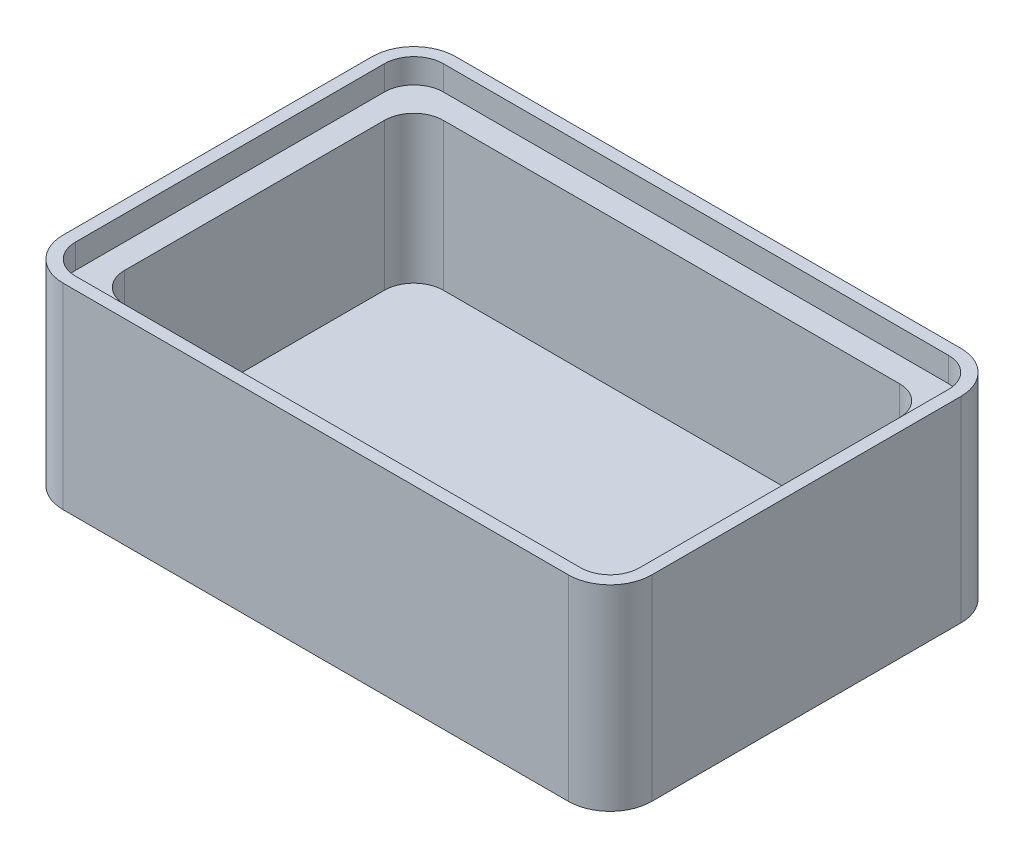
ISO-10303-21;
HEADER;
FILE_DESCRIPTION(('STEP AP214'),'2;1');
FILE_NAME('part.step','',(''),(''),'','','');
FILE_SCHEMA(('AUTOMOTIVE_DESIGN { 1 0 10303 214 1 1 1 1 }'));
ENDSEC;
DATA;
#1=APPLICATION_CONTEXT('core data for automotive mechanical design processes');
#2=APPLICATION_PROTOCOL_DEFINITION('international standard','automotive_design',2000,#1);
#3=PRODUCT_CONTEXT('',#1,'mechanical');
#4=PRODUCT('Part','Part','',(#3));
#5=PRODUCT_RELATED_PRODUCT_CATEGORY('part','',(#4));
#6=PRODUCT_DEFINITION_FORMATION('','',#4);
#7=PRODUCT_DEFINITION_CONTEXT('part definition',#1,'design');
#8=PRODUCT_DEFINITION('design','',#6,#7);
#9=PRODUCT_DEFINITION_SHAPE('','',#8);
#10=(LENGTH_UNIT() NAMED_UNIT(*) SI_UNIT(.MILLI.,.METRE.));
#11=(NAMED_UNIT(*) PLANE_ANGLE_UNIT() SI_UNIT($,.RADIAN.));
#12=(NAMED_UNIT(*) SI_UNIT($,.STERADIAN.) SOLID_ANGLE_UNIT());
#13=UNCERTAINTY_MEASURE_WITH_UNIT(LENGTH_MEASURE(1.E-05),#10,'distance_accuracy_value','');
#14=(GEOMETRIC_REPRESENTATION_CONTEXT(3) GLOBAL_UNCERTAINTY_ASSIGNED_CONTEXT((#13)) GLOBAL_UNIT_ASSIGNED_CONTEXT((#10,
#11,#12)) REPRESENTATION_CONTEXT('',''));
#15=CARTESIAN_POINT('',(0.,0.,0.));
#16=DIRECTION('',(0.,0.,1.));
#17=DIRECTION('',(1.,0.,0.));
#18=AXIS2_PLACEMENT_3D('',#15,#16,#17);
#19=CARTESIAN_POINT('',(-76.2,50.8,-50.8));
#20=DIRECTION('',(1.,0.,0.));
#21=DIRECTION('',(0.,0.,-1.));
#22=AXIS2_PLACEMENT_3D('',#19,#20,#21);
#23=PLANE('',#22);
#24=DIRECTION('',(0.,0.,1.));
#25=VECTOR('',#24,1.);
#26=CARTESIAN_POINT('',(-76.2,0.,-50.8));
#27=LINE('',#26,#25);
#28=CARTESIAN_POINT('',(-76.2,0.,-40.005));
#29=VERTEX_POINT('',#28);
#30=CARTESIAN_POINT('',(-76.2,0.,40.005));
#31=VERTEX_POINT('',#30);
#32=EDGE_CURVE('E250',#29,#31,#27,.T.);
#33=ORIENTED_EDGE('',*,*,#32,.T.);
#34=DIRECTION('',(0.,-1.,0.));
#35=VECTOR('',#34,1.);
#36=CARTESIAN_POINT('',(-76.2,50.8,40.005));
#37=LINE('',#36,#35);
#38=CARTESIAN_POINT('',(-76.2,50.8,40.005));
#39=VERTEX_POINT('',#38);
#40=EDGE_CURVE('E363',#31,#39,#37,.F.);
#41=ORIENTED_EDGE('',*,*,#40,.T.);
#42=DIRECTION('',(0.,0.,1.));
#43=VECTOR('',#42,1.);
#44=CARTESIAN_POINT('',(-76.2,50.8,-50.8));
#45=LINE('',#44,#43);
#46=CARTESIAN_POINT('',(-76.2,50.8,-40.005));
#47=VERTEX_POINT('',#46);
#48=EDGE_CURVE('E251',#47,#39,#45,.T.);
#49=ORIENTED_EDGE('',*,*,#48,.F.);
#50=DIRECTION('',(0.,-1.,0.));
#51=VECTOR('',#50,1.);
#52=CARTESIAN_POINT('',(-76.2,50.8,-40.005));
#53=LINE('',#52,#51);
#54=EDGE_CURVE('E360',#47,#29,#53,.T.);
#55=ORIENTED_EDGE('',*,*,#54,.T.);
#56=EDGE_LOOP('',(#33,#41,#49,#55));
#57=FACE_BOUND('',#56,.T.);
#58=ADVANCED_FACE('F31',(#57),#23,.F.);
#59=CARTESIAN_POINT('',(-76.2,50.8,50.8));
#60=DIRECTION('',(0.,0.,-1.));
#61=DIRECTION('',(-1.,0.,0.));
#62=AXIS2_PLACEMENT_3D('',#59,#60,#61);
#63=PLANE('',#62);
#64=DIRECTION('',(1.,0.,0.));
#65=VECTOR('',#64,1.);
#66=CARTESIAN_POINT('',(-76.2,0.,50.8));
#67=LINE('',#66,#65);
#68=CARTESIAN_POINT('',(-65.405,0.,50.8));
#69=VERTEX_POINT('',#68);
#70=CARTESIAN_POINT('',(65.405,0.,50.8));
#71=VERTEX_POINT('',#70);
#72=EDGE_CURVE('E265',#69,#71,#67,.T.);
#73=ORIENTED_EDGE('',*,*,#72,.T.);
#74=DIRECTION('',(0.,-1.,0.));
#75=VECTOR('',#74,1.);
#76=CARTESIAN_POINT('',(65.405,50.8,50.8));
#77=LINE('',#76,#75);
#78=CARTESIAN_POINT('',(65.405,50.8,50.8));
#79=VERTEX_POINT('',#78);
#80=EDGE_CURVE('E351',#71,#79,#77,.F.);
#81=ORIENTED_EDGE('',*,*,#80,.T.);
#82=DIRECTION('',(1.,0.,0.));
#83=VECTOR('',#82,1.);
#84=CARTESIAN_POINT('',(-76.2,50.8,50.8));
#85=LINE('',#84,#83);
#86=CARTESIAN_POINT('',(-65.405,50.8,50.8));
#87=VERTEX_POINT('',#86);
#88=EDGE_CURVE('E254',#87,#79,#85,.T.);
#89=ORIENTED_EDGE('',*,*,#88,.F.);
#90=DIRECTION('',(0.,-1.,0.));
#91=VECTOR('',#90,1.);
#92=CARTESIAN_POINT('',(-65.405,50.8,50.8));
#93=LINE('',#92,#91);
#94=EDGE_CURVE('E348',#87,#69,#93,.T.);
#95=ORIENTED_EDGE('',*,*,#94,.T.);
#96=EDGE_LOOP('',(#73,#81,#89,#95));
#97=FACE_BOUND('',#96,.T.);
#98=ADVANCED_FACE('F387',(#97),#63,.F.);
#99=CARTESIAN_POINT('',(76.2,50.8,-50.8));
#100=DIRECTION('',(-1.,0.,0.));
#101=DIRECTION('',(0.,0.,1.));
#102=AXIS2_PLACEMENT_3D('',#99,#100,#101);
#103=PLANE('',#102);
#104=DIRECTION('',(0.,0.,-1.));
#105=VECTOR('',#104,1.);
#106=CARTESIAN_POINT('',(76.2,50.8,-50.8));
#107=LINE('',#106,#105);
#108=CARTESIAN_POINT('',(76.2,50.8,40.005));
#109=VERTEX_POINT('',#108);
#110=CARTESIAN_POINT('',(76.2,50.8,-40.005));
#111=VERTEX_POINT('',#110);
#112=EDGE_CURVE('E258',#109,#111,#107,.T.);
#113=ORIENTED_EDGE('',*,*,#112,.F.);
#114=DIRECTION('',(0.,-1.,0.));
#115=VECTOR('',#114,1.);
#116=CARTESIAN_POINT('',(76.2,50.8,40.005));
#117=LINE('',#116,#115);
#118=CARTESIAN_POINT('',(76.2,0.,40.005));
#119=VERTEX_POINT('',#118);
#120=EDGE_CURVE('E337',#109,#119,#117,.T.);
#121=ORIENTED_EDGE('',*,*,#120,.T.);
#122=DIRECTION('',(0.,0.,-1.));
#123=VECTOR('',#122,1.);
#124=CARTESIAN_POINT('',(76.2,0.,-50.8));
#125=LINE('',#124,#123);
#126=CARTESIAN_POINT('',(76.2,0.,-40.005));
#127=VERTEX_POINT('',#126);
#128=EDGE_CURVE('E268',#119,#127,#125,.T.);
#129=ORIENTED_EDGE('',*,*,#128,.T.);
#130=DIRECTION('',(0.,-1.,0.));
#131=VECTOR('',#130,1.);
#132=CARTESIAN_POINT('',(76.2,50.8,-40.005));
#133=LINE('',#132,#131);
#134=EDGE_CURVE('E335',#127,#111,#133,.F.);
#135=ORIENTED_EDGE('',*,*,#134,.T.);
#136=EDGE_LOOP('',(#113,#121,#129,#135));
#137=FACE_BOUND('',#136,.T.);
#138=ADVANCED_FACE('F395',(#137),#103,.F.);
#139=CARTESIAN_POINT('',(-76.2,50.8,-50.8));
#140=DIRECTION('',(0.,0.,1.));
#141=DIRECTION('',(1.,0.,0.));
#142=AXIS2_PLACEMENT_3D('',#139,#140,#141);
#143=PLANE('',#142);
#144=DIRECTION('',(-1.,0.,0.));
#145=VECTOR('',#144,1.);
#146=CARTESIAN_POINT('',(-76.2,0.,-50.8));
#147=LINE('',#146,#145);
#148=CARTESIAN_POINT('',(65.405,0.,-50.8));
#149=VERTEX_POINT('',#148);
#150=CARTESIAN_POINT('',(-65.405,0.,-50.8));
#151=VERTEX_POINT('',#150);
#152=EDGE_CURVE('E255',#149,#151,#147,.T.);
#153=ORIENTED_EDGE('',*,*,#152,.T.);
#154=DIRECTION('',(0.,-1.,0.));
#155=VECTOR('',#154,1.);
#156=CARTESIAN_POINT('',(-65.405,50.8,-50.8));
#157=LINE('',#156,#155);
#158=CARTESIAN_POINT('',(-65.405,50.8,-50.8));
#159=VERTEX_POINT('',#158);
#160=EDGE_CURVE('E11',#151,#159,#157,.F.);
#161=ORIENTED_EDGE('',*,*,#160,.T.);
#162=DIRECTION('',(-1.,0.,0.));
#163=VECTOR('',#162,1.);
#164=CARTESIAN_POINT('',(-76.2,50.8,-50.8));
#165=LINE('',#164,#163);
#166=CARTESIAN_POINT('',(65.405,50.8,-50.8));
#167=VERTEX_POINT('',#166);
#168=EDGE_CURVE('E260',#167,#159,#165,.T.);
#169=ORIENTED_EDGE('',*,*,#168,.F.);
#170=DIRECTION('',(0.,-1.,0.));
#171=VECTOR('',#170,1.);
#172=CARTESIAN_POINT('',(65.405,50.8,-50.8));
#173=LINE('',#172,#171);
#174=EDGE_CURVE('E39',#167,#149,#173,.T.);
#175=ORIENTED_EDGE('',*,*,#174,.T.);
#176=EDGE_LOOP('',(#153,#161,#169,#175));
#177=FACE_BOUND('',#176,.T.);
#178=ADVANCED_FACE('F367',(#177),#143,.F.);
#179=CARTESIAN_POINT('',(-76.2,50.8,50.8));
#180=DIRECTION('',(0.,1.,0.));
#181=DIRECTION('',(0.,0.,1.));
#182=AXIS2_PLACEMENT_3D('',#179,#180,#181);
#183=PLANE('',#182);
#184=DIRECTION('',(-1.,0.,0.));
#185=VECTOR('',#184,1.);
#186=CARTESIAN_POINT('',(73.025,50.8,-47.625));
#187=LINE('',#186,#185);
#188=CARTESIAN_POINT('',(65.405,50.8,-47.625));
#189=VERTEX_POINT('',#188);
#190=CARTESIAN_POINT('',(-65.405,50.8,-47.625));
#191=VERTEX_POINT('',#190);
#192=EDGE_CURVE('E682',#189,#191,#187,.T.);
#193=ORIENTED_EDGE('',*,*,#192,.F.);
#194=CARTESIAN_POINT('',(65.405,50.8,-40.005));
#195=DIRECTION('',(0.,1.,0.));
#196=DIRECTION('',(0.,0.,1.));
#197=AXIS2_PLACEMENT_3D('',#194,#195,#196);
#198=CIRCLE('',#197,7.62);
#199=CARTESIAN_POINT('',(73.025,50.8,-40.005));
#200=VERTEX_POINT('',#199);
#201=EDGE_CURVE('E218',#189,#200,#198,.F.);
#202=ORIENTED_EDGE('',*,*,#201,.T.);
#203=DIRECTION('',(0.,0.,-1.));
#204=VECTOR('',#203,1.);
#205=CARTESIAN_POINT('',(73.025,50.8,47.625));
#206=LINE('',#205,#204);
#207=CARTESIAN_POINT('',(73.025,50.8,40.005));
#208=VERTEX_POINT('',#207);
#209=EDGE_CURVE('E209',#208,#200,#206,.T.);
#210=ORIENTED_EDGE('',*,*,#209,.F.);
#211=CARTESIAN_POINT('',(65.405,50.8,40.005));
#212=DIRECTION('',(0.,1.,0.));
#213=DIRECTION('',(0.,0.,1.));
#214=AXIS2_PLACEMENT_3D('',#211,#212,#213);
#215=CIRCLE('',#214,7.62);
#216=CARTESIAN_POINT('',(65.405,50.8,47.625));
#217=VERTEX_POINT('',#216);
#218=EDGE_CURVE('E192',#208,#217,#215,.F.);
#219=ORIENTED_EDGE('',*,*,#218,.T.);
#220=DIRECTION('',(1.,0.,0.));
#221=VECTOR('',#220,1.);
#222=CARTESIAN_POINT('',(-73.025,50.8,47.625));
#223=LINE('',#222,#221);
#224=CARTESIAN_POINT('',(-65.405,50.8,47.625));
#225=VERTEX_POINT('',#224);
#226=EDGE_CURVE('E220',#225,#217,#223,.T.);
#227=ORIENTED_EDGE('',*,*,#226,.F.);
#228=CARTESIAN_POINT('',(-65.405,50.8,40.005));
#229=DIRECTION('',(0.,1.,0.));
#230=DIRECTION('',(0.,0.,1.));
#231=AXIS2_PLACEMENT_3D('',#228,#229,#230);
#232=CIRCLE('',#231,7.62);
#233=CARTESIAN_POINT('',(-73.025,50.8,40.005));
#234=VERTEX_POINT('',#233);
#235=EDGE_CURVE('E202',#225,#234,#232,.F.);
#236=ORIENTED_EDGE('',*,*,#235,.T.);
#237=DIRECTION('',(0.,0.,1.));
#238=VECTOR('',#237,1.);
#239=CARTESIAN_POINT('',(-73.025,50.8,-47.625));
#240=LINE('',#239,#238);
#241=CARTESIAN_POINT('',(-73.025,50.8,-40.005));
#242=VERTEX_POINT('',#241);
#243=EDGE_CURVE('E225',#242,#234,#240,.T.);
#244=ORIENTED_EDGE('',*,*,#243,.F.);
#245=CARTESIAN_POINT('',(-65.405,50.8,-40.005));
#246=DIRECTION('',(0.,1.,0.));
#247=DIRECTION('',(0.,0.,1.));
#248=AXIS2_PLACEMENT_3D('',#245,#246,#247);
#249=CIRCLE('',#248,7.62);
#250=EDGE_CURVE('E325',#242,#191,#249,.F.);
#251=ORIENTED_EDGE('',*,*,#250,.T.);
#252=EDGE_LOOP('',(#193,#202,#210,#219,#227,#236,#244,#251));
#253=FACE_BOUND('',#252,.T.);
#254=ORIENTED_EDGE('',*,*,#88,.T.);
#255=CARTESIAN_POINT('',(65.405,50.8,40.005));
#256=DIRECTION('',(0.,1.,0.));
#257=DIRECTION('',(0.,0.,1.));
#258=AXIS2_PLACEMENT_3D('',#255,#256,#257);
#259=CIRCLE('',#258,10.795);
#260=EDGE_CURVE('E358',#79,#109,#259,.T.);
#261=ORIENTED_EDGE('',*,*,#260,.T.);
#262=ORIENTED_EDGE('',*,*,#112,.T.);
#263=CARTESIAN_POINT('',(65.405,50.8,-40.005));
#264=DIRECTION('',(0.,1.,0.));
#265=DIRECTION('',(0.,0.,1.));
#266=AXIS2_PLACEMENT_3D('',#263,#264,#265);
#267=CIRCLE('',#266,10.795);
#268=EDGE_CURVE('E51',#111,#167,#267,.T.);
#269=ORIENTED_EDGE('',*,*,#268,.T.);
#270=ORIENTED_EDGE('',*,*,#168,.T.);
#271=CARTESIAN_POINT('',(-65.405,50.8,-40.005));
#272=DIRECTION('',(0.,1.,0.));
#273=DIRECTION('',(0.,0.,1.));
#274=AXIS2_PLACEMENT_3D('',#271,#272,#273);
#275=CIRCLE('',#274,10.795);
#276=EDGE_CURVE('E354',#159,#47,#275,.T.);
#277=ORIENTED_EDGE('',*,*,#276,.T.);
#278=ORIENTED_EDGE('',*,*,#48,.T.);
#279=CARTESIAN_POINT('',(-65.405,50.8,40.005));
#280=DIRECTION('',(0.,1.,0.));
#281=DIRECTION('',(0.,0.,1.));
#282=AXIS2_PLACEMENT_3D('',#279,#280,#281);
#283=CIRCLE('',#282,10.795);
#284=EDGE_CURVE('E356',#39,#87,#283,.T.);
#285=ORIENTED_EDGE('',*,*,#284,.T.);
#286=EDGE_LOOP('',(#254,#261,#262,#269,#270,#277,#278,#285));
#287=FACE_BOUND('',#286,.T.);
#288=ADVANCED_FACE('F217',(#253,#287),#183,.T.);
#289=CARTESIAN_POINT('',(-76.2,0.,50.8));
#290=DIRECTION('',(0.,1.,0.));
#291=DIRECTION('',(0.,0.,1.));
#292=AXIS2_PLACEMENT_3D('',#289,#290,#291);
#293=PLANE('',#292);
#294=ORIENTED_EDGE('',*,*,#128,.F.);
#295=CARTESIAN_POINT('',(65.405,0.,40.005));
#296=DIRECTION('',(0.,1.,0.));
#297=DIRECTION('',(0.,0.,1.));
#298=AXIS2_PLACEMENT_3D('',#295,#296,#297);
#299=CIRCLE('',#298,10.795);
#300=EDGE_CURVE('E346',#119,#71,#299,.F.);
#301=ORIENTED_EDGE('',*,*,#300,.T.);
#302=ORIENTED_EDGE('',*,*,#72,.F.);
#303=CARTESIAN_POINT('',(-65.405,0.,40.005));
#304=DIRECTION('',(0.,1.,0.));
#305=DIRECTION('',(0.,0.,1.));
#306=AXIS2_PLACEMENT_3D('',#303,#304,#305);
#307=CIRCLE('',#306,10.795);
#308=EDGE_CURVE('E344',#69,#31,#307,.F.);
#309=ORIENTED_EDGE('',*,*,#308,.T.);
#310=ORIENTED_EDGE('',*,*,#32,.F.);
#311=CARTESIAN_POINT('',(-65.405,0.,-40.005));
#312=DIRECTION('',(0.,1.,0.));
#313=DIRECTION('',(0.,0.,1.));
#314=AXIS2_PLACEMENT_3D('',#311,#312,#313);
#315=CIRCLE('',#314,10.795);
#316=EDGE_CURVE('E342',#29,#151,#315,.F.);
#317=ORIENTED_EDGE('',*,*,#316,.T.);
#318=ORIENTED_EDGE('',*,*,#152,.F.);
#319=CARTESIAN_POINT('',(65.405,0.,-40.005));
#320=DIRECTION('',(0.,1.,0.));
#321=DIRECTION('',(0.,0.,1.));
#322=AXIS2_PLACEMENT_3D('',#319,#320,#321);
#323=CIRCLE('',#322,10.795);
#324=EDGE_CURVE('E340',#149,#127,#323,.F.);
#325=ORIENTED_EDGE('',*,*,#324,.T.);
#326=EDGE_LOOP('',(#294,#301,#302,#309,#310,#317,#318,#325));
#327=FACE_BOUND('',#326,.T.);
#328=ADVANCED_FACE('F371',(#327),#293,.F.);
#329=CARTESIAN_POINT('',(-73.025,44.45,-47.625));
#330=DIRECTION('',(0.,1.,0.));
#331=DIRECTION('',(0.,0.,1.));
#332=AXIS2_PLACEMENT_3D('',#329,#330,#331);
#333=PLANE('',#332);
#334=DIRECTION('',(1.,0.,0.));
#335=VECTOR('',#334,1.);
#336=CARTESIAN_POINT('',(-73.025,44.45,47.625));
#337=LINE('',#336,#335);
#338=CARTESIAN_POINT('',(-65.405,44.45,47.625));
#339=VERTEX_POINT('',#338);
#340=CARTESIAN_POINT('',(65.405,44.45,47.625));
#341=VERTEX_POINT('',#340);
#342=EDGE_CURVE('E674',#339,#341,#337,.T.);
#343=ORIENTED_EDGE('',*,*,#342,.T.);
#344=CARTESIAN_POINT('',(65.405,44.45,40.005));
#345=DIRECTION('',(0.,1.,0.));
#346=DIRECTION('',(0.,0.,1.));
#347=AXIS2_PLACEMENT_3D('',#344,#345,#346);
#348=CIRCLE('',#347,7.62);
#349=CARTESIAN_POINT('',(73.025,44.45,40.005));
#350=VERTEX_POINT('',#349);
#351=EDGE_CURVE('E284',#341,#350,#348,.T.);
#352=ORIENTED_EDGE('',*,*,#351,.T.);
#353=DIRECTION('',(0.,0.,-1.));
#354=VECTOR('',#353,1.);
#355=CARTESIAN_POINT('',(73.025,44.45,47.625));
#356=LINE('',#355,#354);
#357=CARTESIAN_POINT('',(73.025,44.45,-40.005));
#358=VERTEX_POINT('',#357);
#359=EDGE_CURVE('E212',#350,#358,#356,.T.);
#360=ORIENTED_EDGE('',*,*,#359,.T.);
#361=CARTESIAN_POINT('',(65.405,44.45,-40.005));
#362=DIRECTION('',(0.,1.,0.));
#363=DIRECTION('',(0.,0.,1.));
#364=AXIS2_PLACEMENT_3D('',#361,#362,#363);
#365=CIRCLE('',#364,7.62);
#366=CARTESIAN_POINT('',(65.405,44.45,-47.625));
#367=VERTEX_POINT('',#366);
#368=EDGE_CURVE('E280',#358,#367,#365,.T.);
#369=ORIENTED_EDGE('',*,*,#368,.T.);
#370=DIRECTION('',(-1.,0.,0.));
#371=VECTOR('',#370,1.);
#372=CARTESIAN_POINT('',(73.025,44.45,-47.625));
#373=LINE('',#372,#371);
#374=CARTESIAN_POINT('',(-65.405,44.45,-47.625));
#375=VERTEX_POINT('',#374);
#376=EDGE_CURVE('E219',#367,#375,#373,.T.);
#377=ORIENTED_EDGE('',*,*,#376,.T.);
#378=CARTESIAN_POINT('',(-65.405,44.45,-40.005));
#379=DIRECTION('',(0.,1.,0.));
#380=DIRECTION('',(0.,0.,1.));
#381=AXIS2_PLACEMENT_3D('',#378,#379,#380);
#382=CIRCLE('',#381,7.62);
#383=CARTESIAN_POINT('',(-73.025,44.45,-40.005));
#384=VERTEX_POINT('',#383);
#385=EDGE_CURVE('E278',#375,#384,#382,.T.);
#386=ORIENTED_EDGE('',*,*,#385,.T.);
#387=DIRECTION('',(0.,0.,1.));
#388=VECTOR('',#387,1.);
#389=CARTESIAN_POINT('',(-73.025,44.45,-47.625));
#390=LINE('',#389,#388);
#391=CARTESIAN_POINT('',(-73.025,44.45,40.005));
#392=VERTEX_POINT('',#391);
#393=EDGE_CURVE('E223',#384,#392,#390,.T.);
#394=ORIENTED_EDGE('',*,*,#393,.T.);
#395=CARTESIAN_POINT('',(-65.405,44.45,40.005));
#396=DIRECTION('',(0.,1.,0.));
#397=DIRECTION('',(0.,0.,1.));
#398=AXIS2_PLACEMENT_3D('',#395,#396,#397);
#399=CIRCLE('',#398,7.62);
#400=EDGE_CURVE('E282',#392,#339,#399,.T.);
#401=ORIENTED_EDGE('',*,*,#400,.T.);
#402=EDGE_LOOP('',(#343,#352,#360,#369,#377,#386,#394,#401));
#403=FACE_BOUND('',#402,.T.);
#404=DIRECTION('',(0.,0.,-1.));
#405=VECTOR('',#404,1.);
#406=CARTESIAN_POINT('',(-66.675,44.45,-41.275));
#407=LINE('',#406,#405);
#408=CARTESIAN_POINT('',(-66.675,44.45,33.655));
#409=VERTEX_POINT('',#408);
#410=CARTESIAN_POINT('',(-66.675,44.45,-33.655));
#411=VERTEX_POINT('',#410);
#412=EDGE_CURVE('E262',#409,#411,#407,.T.);
#413=ORIENTED_EDGE('',*,*,#412,.T.);
#414=CARTESIAN_POINT('',(-59.055,44.45,-33.655));
#415=DIRECTION('',(0.,1.,0.));
#416=DIRECTION('',(0.,0.,1.));
#417=AXIS2_PLACEMENT_3D('',#414,#415,#416);
#418=CIRCLE('',#417,7.62);
#419=CARTESIAN_POINT('',(-59.055,44.45,-41.275));
#420=VERTEX_POINT('',#419);
#421=EDGE_CURVE('E333',#411,#420,#418,.F.);
#422=ORIENTED_EDGE('',*,*,#421,.T.);
#423=DIRECTION('',(1.,0.,0.));
#424=VECTOR('',#423,1.);
#425=CARTESIAN_POINT('',(66.675,44.45,-41.275));
#426=LINE('',#425,#424);
#427=CARTESIAN_POINT('',(59.055,44.45,-41.275));
#428=VERTEX_POINT('',#427);
#429=EDGE_CURVE('E235',#420,#428,#426,.T.);
#430=ORIENTED_EDGE('',*,*,#429,.T.);
#431=CARTESIAN_POINT('',(59.055,44.45,-33.655));
#432=DIRECTION('',(0.,1.,0.));
#433=DIRECTION('',(0.,0.,1.));
#434=AXIS2_PLACEMENT_3D('',#431,#432,#433);
#435=CIRCLE('',#434,7.62);
#436=CARTESIAN_POINT('',(66.675,44.45,-33.655));
#437=VERTEX_POINT('',#436);
#438=EDGE_CURVE('E331',#428,#437,#435,.F.);
#439=ORIENTED_EDGE('',*,*,#438,.T.);
#440=DIRECTION('',(0.,0.,1.));
#441=VECTOR('',#440,1.);
#442=CARTESIAN_POINT('',(66.675,44.45,41.275));
#443=LINE('',#442,#441);
#444=CARTESIAN_POINT('',(66.675,44.45,33.655));
#445=VERTEX_POINT('',#444);
#446=EDGE_CURVE('E232',#437,#445,#443,.T.);
#447=ORIENTED_EDGE('',*,*,#446,.T.);
#448=CARTESIAN_POINT('',(59.055,44.45,33.655));
#449=DIRECTION('',(0.,1.,0.));
#450=DIRECTION('',(0.,0.,1.));
#451=AXIS2_PLACEMENT_3D('',#448,#449,#450);
#452=CIRCLE('',#451,7.62);
#453=CARTESIAN_POINT('',(59.055,44.45,41.275));
#454=VERTEX_POINT('',#453);
#455=EDGE_CURVE('E329',#445,#454,#452,.F.);
#456=ORIENTED_EDGE('',*,*,#455,.T.);
#457=DIRECTION('',(-1.,0.,0.));
#458=VECTOR('',#457,1.);
#459=CARTESIAN_POINT('',(-66.675,44.45,41.275));
#460=LINE('',#459,#458);
#461=CARTESIAN_POINT('',(-59.055,44.45,41.275));
#462=VERTEX_POINT('',#461);
#463=EDGE_CURVE('E229',#454,#462,#460,.T.);
#464=ORIENTED_EDGE('',*,*,#463,.T.);
#465=CARTESIAN_POINT('',(-59.055,44.45,33.655));
#466=DIRECTION('',(0.,1.,0.));
#467=DIRECTION('',(0.,0.,1.));
#468=AXIS2_PLACEMENT_3D('',#465,#466,#467);
#469=CIRCLE('',#468,7.62);
#470=EDGE_CURVE('E327',#462,#409,#469,.F.);
#471=ORIENTED_EDGE('',*,*,#470,.T.);
#472=EDGE_LOOP('',(#413,#422,#430,#439,#447,#456,#464,#471));
#473=FACE_BOUND('',#472,.T.);
#474=ADVANCED_FACE('F541',(#403,#473),#333,.T.);
#475=CARTESIAN_POINT('',(73.025,44.45,-47.625));
#476=DIRECTION('',(0.,0.,-1.));
#477=DIRECTION('',(-1.,0.,0.));
#478=AXIS2_PLACEMENT_3D('',#475,#476,#477);
#479=PLANE('',#478);
#480=ORIENTED_EDGE('',*,*,#376,.F.);
#481=DIRECTION('',(0.,1.,0.));
#482=VECTOR('',#481,1.);
#483=CARTESIAN_POINT('',(65.405,50.8,-47.625));
#484=LINE('',#483,#482);
#485=EDGE_CURVE('E293',#367,#189,#484,.T.);
#486=ORIENTED_EDGE('',*,*,#485,.T.);
#487=ORIENTED_EDGE('',*,*,#192,.T.);
#488=DIRECTION('',(0.,1.,0.));
#489=VECTOR('',#488,1.);
#490=CARTESIAN_POINT('',(-65.405,44.45,-47.625));
#491=LINE('',#490,#489);
#492=EDGE_CURVE('E291',#191,#375,#491,.F.);
#493=ORIENTED_EDGE('',*,*,#492,.T.);
#494=EDGE_LOOP('',(#480,#486,#487,#493));
#495=FACE_BOUND('',#494,.T.);
#496=ADVANCED_FACE('F533',(#495),#479,.F.);
#497=CARTESIAN_POINT('',(73.025,44.45,47.625));
#498=DIRECTION('',(1.,0.,0.));
#499=DIRECTION('',(0.,0.,-1.));
#500=AXIS2_PLACEMENT_3D('',#497,#498,#499);
#501=PLANE('',#500);
#502=ORIENTED_EDGE('',*,*,#359,.F.);
#503=DIRECTION('',(0.,1.,0.));
#504=VECTOR('',#503,1.);
#505=CARTESIAN_POINT('',(73.025,50.8,40.005));
#506=LINE('',#505,#504);
#507=EDGE_CURVE('E196',#350,#208,#506,.T.);
#508=ORIENTED_EDGE('',*,*,#507,.T.);
#509=ORIENTED_EDGE('',*,*,#209,.T.);
#510=DIRECTION('',(0.,1.,0.));
#511=VECTOR('',#510,1.);
#512=CARTESIAN_POINT('',(73.025,44.45,-40.005));
#513=LINE('',#512,#511);
#514=EDGE_CURVE('E214',#200,#358,#513,.F.);
#515=ORIENTED_EDGE('',*,*,#514,.T.);
#516=EDGE_LOOP('',(#502,#508,#509,#515));
#517=FACE_BOUND('',#516,.T.);
#518=ADVANCED_FACE('F208',(#517),#501,.F.);
#519=CARTESIAN_POINT('',(-73.025,44.45,47.625));
#520=DIRECTION('',(0.,0.,1.));
#521=DIRECTION('',(1.,0.,0.));
#522=AXIS2_PLACEMENT_3D('',#519,#520,#521);
#523=PLANE('',#522);
#524=ORIENTED_EDGE('',*,*,#226,.T.);
#525=DIRECTION('',(0.,1.,0.));
#526=VECTOR('',#525,1.);
#527=CARTESIAN_POINT('',(65.405,44.45,47.625));
#528=LINE('',#527,#526);
#529=EDGE_CURVE('E197',#217,#341,#528,.F.);
#530=ORIENTED_EDGE('',*,*,#529,.T.);
#531=ORIENTED_EDGE('',*,*,#342,.F.);
#532=DIRECTION('',(0.,1.,0.));
#533=VECTOR('',#532,1.);
#534=CARTESIAN_POINT('',(-65.405,50.8,47.625));
#535=LINE('',#534,#533);
#536=EDGE_CURVE('E213',#339,#225,#535,.T.);
#537=ORIENTED_EDGE('',*,*,#536,.T.);
#538=EDGE_LOOP('',(#524,#530,#531,#537));
#539=FACE_BOUND('',#538,.T.);
#540=ADVANCED_FACE('F515',(#539),#523,.F.);
#541=CARTESIAN_POINT('',(-73.025,44.45,-47.625));
#542=DIRECTION('',(-1.,0.,0.));
#543=DIRECTION('',(0.,0.,1.));
#544=AXIS2_PLACEMENT_3D('',#541,#542,#543);
#545=PLANE('',#544);
#546=ORIENTED_EDGE('',*,*,#243,.T.);
#547=DIRECTION('',(0.,1.,0.));
#548=VECTOR('',#547,1.);
#549=CARTESIAN_POINT('',(-73.025,44.45,40.005));
#550=LINE('',#549,#548);
#551=EDGE_CURVE('E289',#234,#392,#550,.F.);
#552=ORIENTED_EDGE('',*,*,#551,.T.);
#553=ORIENTED_EDGE('',*,*,#393,.F.);
#554=DIRECTION('',(0.,1.,0.));
#555=VECTOR('',#554,1.);
#556=CARTESIAN_POINT('',(-73.025,50.8,-40.005));
#557=LINE('',#556,#555);
#558=EDGE_CURVE('E286',#384,#242,#557,.T.);
#559=ORIENTED_EDGE('',*,*,#558,.T.);
#560=EDGE_LOOP('',(#546,#552,#553,#559));
#561=FACE_BOUND('',#560,.T.);
#562=ADVANCED_FACE('F508',(#561),#545,.F.);
#563=CARTESIAN_POINT('',(-66.675,6.35,-41.275));
#564=DIRECTION('',(0.,1.,0.));
#565=DIRECTION('',(0.,0.,1.));
#566=AXIS2_PLACEMENT_3D('',#563,#564,#565);
#567=PLANE('',#566);
#568=DIRECTION('',(0.,0.,1.));
#569=VECTOR('',#568,1.);
#570=CARTESIAN_POINT('',(-66.675,6.35,-41.275));
#571=LINE('',#570,#569);
#572=CARTESIAN_POINT('',(-66.675,6.35,-33.655));
#573=VERTEX_POINT('',#572);
#574=CARTESIAN_POINT('',(-66.675,6.35,33.655));
#575=VERTEX_POINT('',#574);
#576=EDGE_CURVE('E241',#573,#575,#571,.T.);
#577=ORIENTED_EDGE('',*,*,#576,.T.);
#578=CARTESIAN_POINT('',(-59.055,6.35,33.655));
#579=DIRECTION('',(0.,1.,0.));
#580=DIRECTION('',(0.,0.,1.));
#581=AXIS2_PLACEMENT_3D('',#578,#579,#580);
#582=CIRCLE('',#581,7.62);
#583=CARTESIAN_POINT('',(-59.055,6.35,41.275));
#584=VERTEX_POINT('',#583);
#585=EDGE_CURVE('E312',#575,#584,#582,.T.);
#586=ORIENTED_EDGE('',*,*,#585,.T.);
#587=DIRECTION('',(1.,0.,0.));
#588=VECTOR('',#587,1.);
#589=CARTESIAN_POINT('',(-66.675,6.35,41.275));
#590=LINE('',#589,#588);
#591=CARTESIAN_POINT('',(59.055,6.35,41.275));
#592=VERTEX_POINT('',#591);
#593=EDGE_CURVE('E244',#584,#592,#590,.T.);
#594=ORIENTED_EDGE('',*,*,#593,.T.);
#595=CARTESIAN_POINT('',(59.055,6.35,33.655));
#596=DIRECTION('',(0.,1.,0.));
#597=DIRECTION('',(0.,0.,1.));
#598=AXIS2_PLACEMENT_3D('',#595,#596,#597);
#599=CIRCLE('',#598,7.62);
#600=CARTESIAN_POINT('',(66.675,6.35,33.655));
#601=VERTEX_POINT('',#600);
#602=EDGE_CURVE('E310',#592,#601,#599,.T.);
#603=ORIENTED_EDGE('',*,*,#602,.T.);
#604=DIRECTION('',(0.,0.,-1.));
#605=VECTOR('',#604,1.);
#606=CARTESIAN_POINT('',(66.675,6.35,41.275));
#607=LINE('',#606,#605);
#608=CARTESIAN_POINT('',(66.675,6.35,-33.655));
#609=VERTEX_POINT('',#608);
#610=EDGE_CURVE('E247',#601,#609,#607,.T.);
#611=ORIENTED_EDGE('',*,*,#610,.T.);
#612=CARTESIAN_POINT('',(59.055,6.35,-33.655));
#613=DIRECTION('',(0.,1.,0.));
#614=DIRECTION('',(0.,0.,1.));
#615=AXIS2_PLACEMENT_3D('',#612,#613,#614);
#616=CIRCLE('',#615,7.62);
#617=CARTESIAN_POINT('',(59.055,6.35,-41.275));
#618=VERTEX_POINT('',#617);
#619=EDGE_CURVE('E308',#609,#618,#616,.T.);
#620=ORIENTED_EDGE('',*,*,#619,.T.);
#621=DIRECTION('',(-1.,0.,0.));
#622=VECTOR('',#621,1.);
#623=CARTESIAN_POINT('',(66.675,6.35,-41.275));
#624=LINE('',#623,#622);
#625=CARTESIAN_POINT('',(-59.055,6.35,-41.275));
#626=VERTEX_POINT('',#625);
#627=EDGE_CURVE('E238',#618,#626,#624,.T.);
#628=ORIENTED_EDGE('',*,*,#627,.T.);
#629=CARTESIAN_POINT('',(-59.055,6.35,-33.655));
#630=DIRECTION('',(0.,1.,0.));
#631=DIRECTION('',(0.,0.,1.));
#632=AXIS2_PLACEMENT_3D('',#629,#630,#631);
#633=CIRCLE('',#632,7.62);
#634=EDGE_CURVE('E306',#626,#573,#633,.T.);
#635=ORIENTED_EDGE('',*,*,#634,.T.);
#636=EDGE_LOOP('',(#577,#586,#594,#603,#611,#620,#628,#635));
#637=FACE_BOUND('',#636,.T.);
#638=ADVANCED_FACE('F514',(#637),#567,.T.);
#639=CARTESIAN_POINT('',(-66.675,6.35,-41.275));
#640=DIRECTION('',(-1.,0.,0.));
#641=DIRECTION('',(0.,0.,1.));
#642=AXIS2_PLACEMENT_3D('',#639,#640,#641);
#643=PLANE('',#642);
#644=ORIENTED_EDGE('',*,*,#412,.F.);
#645=DIRECTION('',(0.,1.,0.));
#646=VECTOR('',#645,1.);
#647=CARTESIAN_POINT('',(-66.675,6.35,33.655));
#648=LINE('',#647,#646);
#649=EDGE_CURVE('E304',#409,#575,#648,.F.);
#650=ORIENTED_EDGE('',*,*,#649,.T.);
#651=ORIENTED_EDGE('',*,*,#576,.F.);
#652=DIRECTION('',(0.,1.,0.));
#653=VECTOR('',#652,1.);
#654=CARTESIAN_POINT('',(-66.675,44.45,-33.655));
#655=LINE('',#654,#653);
#656=EDGE_CURVE('E301',#573,#411,#655,.T.);
#657=ORIENTED_EDGE('',*,*,#656,.T.);
#658=EDGE_LOOP('',(#644,#650,#651,#657));
#659=FACE_BOUND('',#658,.T.);
#660=ADVANCED_FACE('F575',(#659),#643,.F.);
#661=CARTESIAN_POINT('',(-66.675,6.35,41.275));
#662=DIRECTION('',(0.,0.,1.));
#663=DIRECTION('',(1.,0.,0.));
#664=AXIS2_PLACEMENT_3D('',#661,#662,#663);
#665=PLANE('',#664);
#666=ORIENTED_EDGE('',*,*,#593,.F.);
#667=DIRECTION('',(0.,1.,0.));
#668=VECTOR('',#667,1.);
#669=CARTESIAN_POINT('',(-59.055,44.45,41.275));
#670=LINE('',#669,#668);
#671=EDGE_CURVE('E298',#584,#462,#670,.T.);
#672=ORIENTED_EDGE('',*,*,#671,.T.);
#673=ORIENTED_EDGE('',*,*,#463,.F.);
#674=DIRECTION('',(0.,1.,0.));
#675=VECTOR('',#674,1.);
#676=CARTESIAN_POINT('',(59.055,6.35,41.275));
#677=LINE('',#676,#675);
#678=EDGE_CURVE('E296',#454,#592,#677,.F.);
#679=ORIENTED_EDGE('',*,*,#678,.T.);
#680=EDGE_LOOP('',(#666,#672,#673,#679));
#681=FACE_BOUND('',#680,.T.);
#682=ADVANCED_FACE('F566',(#681),#665,.F.);
#683=CARTESIAN_POINT('',(66.675,6.35,41.275));
#684=DIRECTION('',(1.,0.,0.));
#685=DIRECTION('',(0.,0.,-1.));
#686=AXIS2_PLACEMENT_3D('',#683,#684,#685);
#687=PLANE('',#686);
#688=ORIENTED_EDGE('',*,*,#610,.F.);
#689=DIRECTION('',(0.,1.,0.));
#690=VECTOR('',#689,1.);
#691=CARTESIAN_POINT('',(66.675,44.45,33.655));
#692=LINE('',#691,#690);
#693=EDGE_CURVE('E316',#601,#445,#692,.T.);
#694=ORIENTED_EDGE('',*,*,#693,.T.);
#695=ORIENTED_EDGE('',*,*,#446,.F.);
#696=DIRECTION('',(0.,1.,0.));
#697=VECTOR('',#696,1.);
#698=CARTESIAN_POINT('',(66.675,6.35,-33.655));
#699=LINE('',#698,#697);
#700=EDGE_CURVE('E314',#437,#609,#699,.F.);
#701=ORIENTED_EDGE('',*,*,#700,.T.);
#702=EDGE_LOOP('',(#688,#694,#695,#701));
#703=FACE_BOUND('',#702,.T.);
#704=ADVANCED_FACE('F557',(#703),#687,.F.);
#705=CARTESIAN_POINT('',(66.675,6.35,-41.275));
#706=DIRECTION('',(0.,0.,-1.));
#707=DIRECTION('',(-1.,0.,0.));
#708=AXIS2_PLACEMENT_3D('',#705,#706,#707);
#709=PLANE('',#708);
#710=ORIENTED_EDGE('',*,*,#627,.F.);
#711=DIRECTION('',(0.,1.,0.));
#712=VECTOR('',#711,1.);
#713=CARTESIAN_POINT('',(59.055,44.45,-41.275));
#714=LINE('',#713,#712);
#715=EDGE_CURVE('E203',#618,#428,#714,.T.);
#716=ORIENTED_EDGE('',*,*,#715,.T.);
#717=ORIENTED_EDGE('',*,*,#429,.F.);
#718=DIRECTION('',(0.,1.,0.));
#719=VECTOR('',#718,1.);
#720=CARTESIAN_POINT('',(-59.055,6.35,-41.275));
#721=LINE('',#720,#719);
#722=EDGE_CURVE('E319',#420,#626,#721,.F.);
#723=ORIENTED_EDGE('',*,*,#722,.T.);
#724=EDGE_LOOP('',(#710,#716,#717,#723));
#725=FACE_BOUND('',#724,.T.);
#726=ADVANCED_FACE('F412',(#725),#709,.F.);
#727=CARTESIAN_POINT('',(65.405,44.45,40.005));
#728=DIRECTION('',(0.,-1.,0.));
#729=DIRECTION('',(0.,0.,-1.));
#730=AXIS2_PLACEMENT_3D('',#727,#728,#729);
#731=CYLINDRICAL_SURFACE('',#730,7.62);
#732=ORIENTED_EDGE('',*,*,#351,.F.);
#733=ORIENTED_EDGE('',*,*,#529,.F.);
#734=ORIENTED_EDGE('',*,*,#218,.F.);
#735=ORIENTED_EDGE('',*,*,#507,.F.);
#736=EDGE_LOOP('',(#732,#733,#734,#735));
#737=FACE_BOUND('',#736,.T.);
#738=ADVANCED_FACE('F195',(#737),#731,.F.);
#739=CARTESIAN_POINT('',(-65.405,44.45,40.005));
#740=DIRECTION('',(0.,-1.,0.));
#741=DIRECTION('',(0.,0.,-1.));
#742=AXIS2_PLACEMENT_3D('',#739,#740,#741);
#743=CYLINDRICAL_SURFACE('',#742,7.62);
#744=ORIENTED_EDGE('',*,*,#400,.F.);
#745=ORIENTED_EDGE('',*,*,#551,.F.);
#746=ORIENTED_EDGE('',*,*,#235,.F.);
#747=ORIENTED_EDGE('',*,*,#536,.F.);
#748=EDGE_LOOP('',(#744,#745,#746,#747));
#749=FACE_BOUND('',#748,.T.);
#750=ADVANCED_FACE('F411',(#749),#743,.F.);
#751=CARTESIAN_POINT('',(65.405,44.45,-40.005));
#752=DIRECTION('',(0.,-1.,0.));
#753=DIRECTION('',(0.,0.,-1.));
#754=AXIS2_PLACEMENT_3D('',#751,#752,#753);
#755=CYLINDRICAL_SURFACE('',#754,7.62);
#756=ORIENTED_EDGE('',*,*,#368,.F.);
#757=ORIENTED_EDGE('',*,*,#514,.F.);
#758=ORIENTED_EDGE('',*,*,#201,.F.);
#759=ORIENTED_EDGE('',*,*,#485,.F.);
#760=EDGE_LOOP('',(#756,#757,#758,#759));
#761=FACE_BOUND('',#760,.T.);
#762=ADVANCED_FACE('F415',(#761),#755,.F.);
#763=CARTESIAN_POINT('',(-65.405,44.45,-40.005));
#764=DIRECTION('',(0.,-1.,0.));
#765=DIRECTION('',(0.,0.,-1.));
#766=AXIS2_PLACEMENT_3D('',#763,#764,#765);
#767=CYLINDRICAL_SURFACE('',#766,7.62);
#768=ORIENTED_EDGE('',*,*,#385,.F.);
#769=ORIENTED_EDGE('',*,*,#492,.F.);
#770=ORIENTED_EDGE('',*,*,#250,.F.);
#771=ORIENTED_EDGE('',*,*,#558,.F.);
#772=EDGE_LOOP('',(#768,#769,#770,#771));
#773=FACE_BOUND('',#772,.T.);
#774=ADVANCED_FACE('F419',(#773),#767,.F.);
#775=CARTESIAN_POINT('',(-59.055,6.35,33.655));
#776=DIRECTION('',(0.,-1.,0.));
#777=DIRECTION('',(0.,0.,-1.));
#778=AXIS2_PLACEMENT_3D('',#775,#776,#777);
#779=CYLINDRICAL_SURFACE('',#778,7.62);
#780=ORIENTED_EDGE('',*,*,#585,.F.);
#781=ORIENTED_EDGE('',*,*,#649,.F.);
#782=ORIENTED_EDGE('',*,*,#470,.F.);
#783=ORIENTED_EDGE('',*,*,#671,.F.);
#784=EDGE_LOOP('',(#780,#781,#782,#783));
#785=FACE_BOUND('',#784,.T.);
#786=ADVANCED_FACE('F423',(#785),#779,.F.);
#787=CARTESIAN_POINT('',(59.055,6.35,33.655));
#788=DIRECTION('',(0.,-1.,0.));
#789=DIRECTION('',(0.,0.,-1.));
#790=AXIS2_PLACEMENT_3D('',#787,#788,#789);
#791=CYLINDRICAL_SURFACE('',#790,7.62);
#792=ORIENTED_EDGE('',*,*,#602,.F.);
#793=ORIENTED_EDGE('',*,*,#678,.F.);
#794=ORIENTED_EDGE('',*,*,#455,.F.);
#795=ORIENTED_EDGE('',*,*,#693,.F.);
#796=EDGE_LOOP('',(#792,#793,#794,#795));
#797=FACE_BOUND('',#796,.T.);
#798=ADVANCED_FACE('F427',(#797),#791,.F.);
#799=CARTESIAN_POINT('',(59.055,6.35,-33.655));
#800=DIRECTION('',(0.,-1.,0.));
#801=DIRECTION('',(0.,0.,-1.));
#802=AXIS2_PLACEMENT_3D('',#799,#800,#801);
#803=CYLINDRICAL_SURFACE('',#802,7.62);
#804=ORIENTED_EDGE('',*,*,#619,.F.);
#805=ORIENTED_EDGE('',*,*,#700,.F.);
#806=ORIENTED_EDGE('',*,*,#438,.F.);
#807=ORIENTED_EDGE('',*,*,#715,.F.);
#808=EDGE_LOOP('',(#804,#805,#806,#807));
#809=FACE_BOUND('',#808,.T.);
#810=ADVANCED_FACE('F431',(#809),#803,.F.);
#811=CARTESIAN_POINT('',(-59.055,6.35,-33.655));
#812=DIRECTION('',(0.,-1.,0.));
#813=DIRECTION('',(0.,0.,-1.));
#814=AXIS2_PLACEMENT_3D('',#811,#812,#813);
#815=CYLINDRICAL_SURFACE('',#814,7.62);
#816=ORIENTED_EDGE('',*,*,#634,.F.);
#817=ORIENTED_EDGE('',*,*,#722,.F.);
#818=ORIENTED_EDGE('',*,*,#421,.F.);
#819=ORIENTED_EDGE('',*,*,#656,.F.);
#820=EDGE_LOOP('',(#816,#817,#818,#819));
#821=FACE_BOUND('',#820,.T.);
#822=ADVANCED_FACE('F435',(#821),#815,.F.);
#823=CARTESIAN_POINT('',(65.405,50.8,40.005));
#824=DIRECTION('',(0.,-1.,0.));
#825=DIRECTION('',(0.,0.,-1.));
#826=AXIS2_PLACEMENT_3D('',#823,#824,#825);
#827=CYLINDRICAL_SURFACE('',#826,10.795);
#828=ORIENTED_EDGE('',*,*,#260,.F.);
#829=ORIENTED_EDGE('',*,*,#80,.F.);
#830=ORIENTED_EDGE('',*,*,#300,.F.);
#831=ORIENTED_EDGE('',*,*,#120,.F.);
#832=EDGE_LOOP('',(#828,#829,#830,#831));
#833=FACE_BOUND('',#832,.T.);
#834=ADVANCED_FACE('F392',(#833),#827,.T.);
#835=CARTESIAN_POINT('',(-65.405,50.8,40.005));
#836=DIRECTION('',(0.,-1.,0.));
#837=DIRECTION('',(0.,0.,-1.));
#838=AXIS2_PLACEMENT_3D('',#835,#836,#837);
#839=CYLINDRICAL_SURFACE('',#838,10.795);
#840=ORIENTED_EDGE('',*,*,#284,.F.);
#841=ORIENTED_EDGE('',*,*,#40,.F.);
#842=ORIENTED_EDGE('',*,*,#308,.F.);
#843=ORIENTED_EDGE('',*,*,#94,.F.);
#844=EDGE_LOOP('',(#840,#841,#842,#843));
#845=FACE_BOUND('',#844,.T.);
#846=ADVANCED_FACE('F384',(#845),#839,.T.);
#847=CARTESIAN_POINT('',(-65.405,50.8,-40.005));
#848=DIRECTION('',(0.,-1.,0.));
#849=DIRECTION('',(0.,0.,-1.));
#850=AXIS2_PLACEMENT_3D('',#847,#848,#849);
#851=CYLINDRICAL_SURFACE('',#850,10.795);
#852=ORIENTED_EDGE('',*,*,#276,.F.);
#853=ORIENTED_EDGE('',*,*,#160,.F.);
#854=ORIENTED_EDGE('',*,*,#316,.F.);
#855=ORIENTED_EDGE('',*,*,#54,.F.);
#856=EDGE_LOOP('',(#852,#853,#854,#855));
#857=FACE_BOUND('',#856,.T.);
#858=ADVANCED_FACE('F376',(#857),#851,.T.);
#859=CARTESIAN_POINT('',(65.405,50.8,-40.005));
#860=DIRECTION('',(0.,-1.,0.));
#861=DIRECTION('',(0.,0.,-1.));
#862=AXIS2_PLACEMENT_3D('',#859,#860,#861);
#863=CYLINDRICAL_SURFACE('',#862,10.795);
#864=ORIENTED_EDGE('',*,*,#268,.F.);
#865=ORIENTED_EDGE('',*,*,#134,.F.);
#866=ORIENTED_EDGE('',*,*,#324,.F.);
#867=ORIENTED_EDGE('',*,*,#174,.F.);
#868=EDGE_LOOP('',(#864,#865,#866,#867));
#869=FACE_BOUND('',#868,.T.);
#870=ADVANCED_FACE('F33',(#869),#863,.T.);
#871=CLOSED_SHELL('',(#58,#98,#138,#178,#288,#328,#474,#496,#518,#540,#562,#638,#660,#682,#704,
#726,#738,#750,#762,#774,#786,#798,#810,#822,#834,#846,#858,#870));
#872=MANIFOLD_SOLID_BREP('B2',#871);
#873=ADVANCED_BREP_SHAPE_REPRESENTATION('',(#18,#872),#14);
#874=SHAPE_DEFINITION_REPRESENTATION(#9,#873);
ENDSEC;
END-ISO-10303-21;
